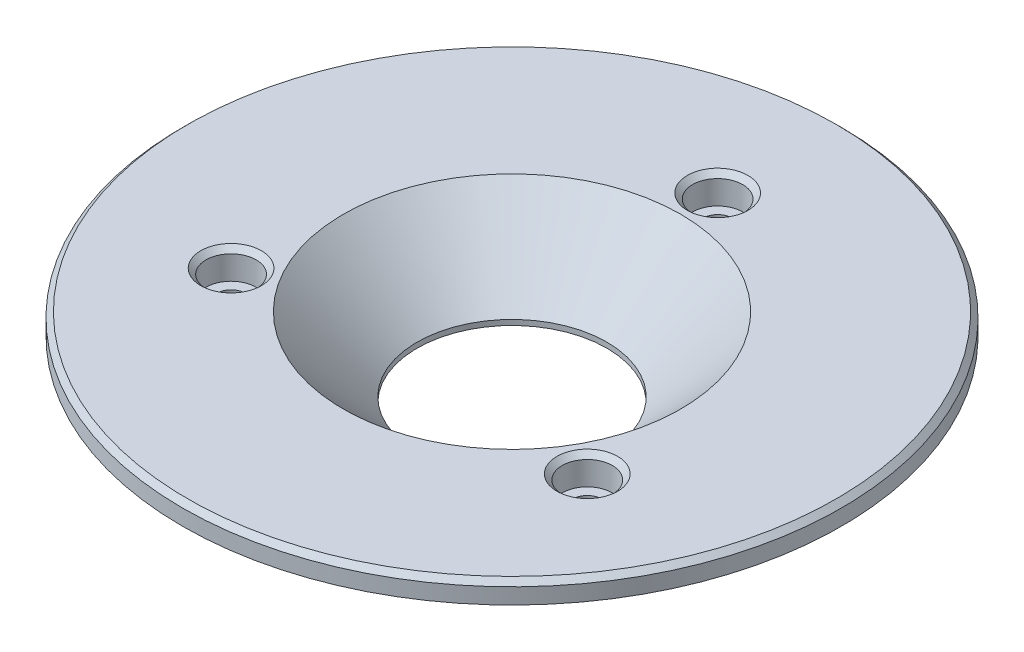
ISO-10303-21;
HEADER;
FILE_DESCRIPTION(('STEP AP214'),'2;1');
FILE_NAME('part.step','',(''),(''),'','','');
FILE_SCHEMA(('AUTOMOTIVE_DESIGN { 1 0 10303 214 1 1 1 1 }'));
ENDSEC;
DATA;
#1=APPLICATION_CONTEXT('core data for automotive mechanical design processes');
#2=APPLICATION_PROTOCOL_DEFINITION('international standard','automotive_design',2000,#1);
#3=PRODUCT_CONTEXT('',#1,'mechanical');
#4=PRODUCT('Part','Part','',(#3));
#5=PRODUCT_RELATED_PRODUCT_CATEGORY('part','',(#4));
#6=PRODUCT_DEFINITION_FORMATION('','',#4);
#7=PRODUCT_DEFINITION_CONTEXT('part definition',#1,'design');
#8=PRODUCT_DEFINITION('design','',#6,#7);
#9=PRODUCT_DEFINITION_SHAPE('','',#8);
#10=(LENGTH_UNIT() NAMED_UNIT(*) SI_UNIT(.MILLI.,.METRE.));
#11=(NAMED_UNIT(*) PLANE_ANGLE_UNIT() SI_UNIT($,.RADIAN.));
#12=(NAMED_UNIT(*) SI_UNIT($,.STERADIAN.) SOLID_ANGLE_UNIT());
#13=UNCERTAINTY_MEASURE_WITH_UNIT(LENGTH_MEASURE(1.E-05),#10,'distance_accuracy_value','');
#14=(GEOMETRIC_REPRESENTATION_CONTEXT(3) GLOBAL_UNCERTAINTY_ASSIGNED_CONTEXT((#13)) GLOBAL_UNIT_ASSIGNED_CONTEXT((#10,
#11,#12)) REPRESENTATION_CONTEXT('',''));
#15=CARTESIAN_POINT('',(0.,0.,0.));
#16=DIRECTION('',(0.,0.,1.));
#17=DIRECTION('',(1.,0.,0.));
#18=AXIS2_PLACEMENT_3D('',#15,#16,#17);
#19=CARTESIAN_POINT('',(-32.,15.,0.));
#20=DIRECTION('',(0.,-1.,0.));
#21=DIRECTION('',(0.,0.,-1.));
#22=AXIS2_PLACEMENT_3D('',#19,#20,#21);
#23=PLANE('',#22);
#24=CARTESIAN_POINT('',(33.7749907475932,15.,19.5));
#25=DIRECTION('',(0.,-1.,0.));
#26=DIRECTION('',(0.,0.,-1.));
#27=AXIS2_PLACEMENT_3D('',#24,#25,#26);
#28=CIRCLE('',#27,5.75);
#29=CARTESIAN_POINT('',(33.7749907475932,15.,13.75));
#30=VERTEX_POINT('',#29);
#31=EDGE_CURVE('E25',#30,#30,#28,.T.);
#32=ORIENTED_EDGE('',*,*,#31,.T.);
#33=EDGE_LOOP('',(#32));
#34=FACE_BOUND('',#33,.T.);
#35=CARTESIAN_POINT('',(0.,15.,-39.));
#36=DIRECTION('',(0.,-1.,0.));
#37=DIRECTION('',(0.,0.,-1.));
#38=AXIS2_PLACEMENT_3D('',#35,#36,#37);
#39=CIRCLE('',#38,5.75);
#40=CARTESIAN_POINT('',(0.,15.,-44.75));
#41=VERTEX_POINT('',#40);
#42=EDGE_CURVE('E29',#41,#41,#39,.T.);
#43=ORIENTED_EDGE('',*,*,#42,.T.);
#44=EDGE_LOOP('',(#43));
#45=FACE_BOUND('',#44,.T.);
#46=CARTESIAN_POINT('',(-33.7749907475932,15.,19.5));
#47=DIRECTION('',(0.,-1.,0.));
#48=DIRECTION('',(0.,0.,-1.));
#49=AXIS2_PLACEMENT_3D('',#46,#47,#48);
#50=CIRCLE('',#49,5.75);
#51=CARTESIAN_POINT('',(-33.7749907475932,15.,13.75));
#52=VERTEX_POINT('',#51);
#53=EDGE_CURVE('E34',#52,#52,#50,.T.);
#54=ORIENTED_EDGE('',*,*,#53,.T.);
#55=EDGE_LOOP('',(#54));
#56=FACE_BOUND('',#55,.T.);
#57=CARTESIAN_POINT('',(0.,15.,0.));
#58=DIRECTION('',(0.,-1.,0.));
#59=DIRECTION('',(0.,0.,-1.));
#60=AXIS2_PLACEMENT_3D('',#57,#58,#59);
#61=CIRCLE('',#60,61.5);
#62=CARTESIAN_POINT('',(0.,15.,-61.5));
#63=VERTEX_POINT('',#62);
#64=EDGE_CURVE('E58',#63,#63,#61,.F.);
#65=ORIENTED_EDGE('',*,*,#64,.T.);
#66=EDGE_LOOP('',(#65));
#67=FACE_BOUND('',#66,.T.);
#68=CARTESIAN_POINT('',(0.,15.,0.));
#69=DIRECTION('',(0.,-1.,0.));
#70=DIRECTION('',(0.,0.,-1.));
#71=AXIS2_PLACEMENT_3D('',#68,#69,#70);
#72=CIRCLE('',#71,32.);
#73=CARTESIAN_POINT('',(0.,15.,-32.));
#74=VERTEX_POINT('',#73);
#75=EDGE_CURVE('E70',#74,#74,#72,.T.);
#76=ORIENTED_EDGE('',*,*,#75,.T.);
#77=EDGE_LOOP('',(#76));
#78=FACE_BOUND('',#77,.T.);
#79=ADVANCED_FACE('F14',(#34,#45,#56,#67,#78),#23,.F.);
#80=CARTESIAN_POINT('',(0.,1.,0.));
#81=DIRECTION('',(0.,1.,0.));
#82=DIRECTION('',(0.,0.,1.));
#83=AXIS2_PLACEMENT_3D('',#80,#81,#82);
#84=CONICAL_SURFACE('',#83,18.,0.78539816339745);
#85=ORIENTED_EDGE('',*,*,#75,.F.);
#86=EDGE_LOOP('',(#85));
#87=FACE_BOUND('',#86,.T.);
#88=CARTESIAN_POINT('',(0.,1.,0.));
#89=DIRECTION('',(0.,-1.,0.));
#90=DIRECTION('',(0.,0.,-1.));
#91=AXIS2_PLACEMENT_3D('',#88,#89,#90);
#92=CIRCLE('',#91,18.);
#93=CARTESIAN_POINT('',(0.,1.,-18.));
#94=VERTEX_POINT('',#93);
#95=EDGE_CURVE('E83',#94,#94,#92,.T.);
#96=ORIENTED_EDGE('',*,*,#95,.T.);
#97=EDGE_LOOP('',(#96));
#98=FACE_BOUND('',#97,.T.);
#99=ADVANCED_FACE('F123',(#87,#98),#84,.F.);
#100=CARTESIAN_POINT('',(0.,0.,0.));
#101=DIRECTION('',(0.,-1.,0.));
#102=DIRECTION('',(0.,0.,-1.));
#103=AXIS2_PLACEMENT_3D('',#100,#101,#102);
#104=CYLINDRICAL_SURFACE('',#103,18.);
#105=ORIENTED_EDGE('',*,*,#95,.F.);
#106=EDGE_LOOP('',(#105));
#107=FACE_BOUND('',#106,.T.);
#108=CARTESIAN_POINT('',(0.,0.,0.));
#109=DIRECTION('',(0.,-1.,0.));
#110=DIRECTION('',(0.,0.,-1.));
#111=AXIS2_PLACEMENT_3D('',#108,#109,#110);
#112=CIRCLE('',#111,18.);
#113=CARTESIAN_POINT('',(0.,0.,-18.));
#114=VERTEX_POINT('',#113);
#115=EDGE_CURVE('E86',#114,#114,#112,.T.);
#116=ORIENTED_EDGE('',*,*,#115,.T.);
#117=EDGE_LOOP('',(#116));
#118=FACE_BOUND('',#117,.T.);
#119=ADVANCED_FACE('F130',(#107,#118),#104,.F.);
#120=CARTESIAN_POINT('',(-18.,0.,0.));
#121=DIRECTION('',(0.,1.,0.));
#122=DIRECTION('',(0.,0.,1.));
#123=AXIS2_PLACEMENT_3D('',#120,#121,#122);
#124=PLANE('',#123);
#125=CARTESIAN_POINT('',(-33.7749907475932,0.,19.5));
#126=DIRECTION('',(0.,1.,0.));
#127=DIRECTION('',(0.,0.,1.));
#128=AXIS2_PLACEMENT_3D('',#125,#126,#127);
#129=CIRCLE('',#128,3.74999999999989);
#130=CARTESIAN_POINT('',(-33.7749907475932,0.,23.2499999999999));
#131=VERTEX_POINT('',#130);
#132=EDGE_CURVE('E49',#131,#131,#129,.T.);
#133=ORIENTED_EDGE('',*,*,#132,.T.);
#134=EDGE_LOOP('',(#133));
#135=FACE_BOUND('',#134,.T.);
#136=CARTESIAN_POINT('',(33.7749907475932,0.,19.5));
#137=DIRECTION('',(0.,1.,0.));
#138=DIRECTION('',(0.,0.,1.));
#139=AXIS2_PLACEMENT_3D('',#136,#137,#138);
#140=CIRCLE('',#139,3.74999999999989);
#141=CARTESIAN_POINT('',(33.7749907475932,0.,23.2499999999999));
#142=VERTEX_POINT('',#141);
#143=EDGE_CURVE('E52',#142,#142,#140,.T.);
#144=ORIENTED_EDGE('',*,*,#143,.T.);
#145=EDGE_LOOP('',(#144));
#146=FACE_BOUND('',#145,.T.);
#147=CARTESIAN_POINT('',(0.,0.,-39.));
#148=DIRECTION('',(0.,1.,0.));
#149=DIRECTION('',(0.,0.,1.));
#150=AXIS2_PLACEMENT_3D('',#147,#148,#149);
#151=CIRCLE('',#150,3.74999999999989);
#152=CARTESIAN_POINT('',(0.,0.,-35.2500000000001));
#153=VERTEX_POINT('',#152);
#154=EDGE_CURVE('E55',#153,#153,#151,.T.);
#155=ORIENTED_EDGE('',*,*,#154,.T.);
#156=EDGE_LOOP('',(#155));
#157=FACE_BOUND('',#156,.T.);
#158=CARTESIAN_POINT('',(0.,0.,0.));
#159=DIRECTION('',(0.,1.,0.));
#160=DIRECTION('',(0.,0.,1.));
#161=AXIS2_PLACEMENT_3D('',#158,#159,#160);
#162=CIRCLE('',#161,44.);
#163=CARTESIAN_POINT('',(0.,0.,44.));
#164=VERTEX_POINT('',#163);
#165=EDGE_CURVE('E67',#164,#164,#162,.F.);
#166=ORIENTED_EDGE('',*,*,#165,.T.);
#167=EDGE_LOOP('',(#166));
#168=FACE_BOUND('',#167,.T.);
#169=ORIENTED_EDGE('',*,*,#115,.F.);
#170=EDGE_LOOP('',(#169));
#171=FACE_BOUND('',#170,.T.);
#172=ADVANCED_FACE('F181',(#135,#146,#157,#168,#171),#124,.F.);
#173=CARTESIAN_POINT('',(0.,0.,0.));
#174=DIRECTION('',(0.,-1.,0.));
#175=DIRECTION('',(0.,0.,-1.));
#176=AXIS2_PLACEMENT_3D('',#173,#174,#175);
#177=CYLINDRICAL_SURFACE('',#176,45.);
#178=CARTESIAN_POINT('',(0.,1.00000000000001,0.));
#179=DIRECTION('',(0.,1.,0.));
#180=DIRECTION('',(0.,0.,1.));
#181=AXIS2_PLACEMENT_3D('',#178,#179,#180);
#182=CIRCLE('',#181,45.);
#183=CARTESIAN_POINT('',(0.,1.00000000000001,45.));
#184=VERTEX_POINT('',#183);
#185=EDGE_CURVE('E64',#184,#184,#182,.T.);
#186=ORIENTED_EDGE('',*,*,#185,.T.);
#187=EDGE_LOOP('',(#186));
#188=FACE_BOUND('',#187,.T.);
#189=CARTESIAN_POINT('',(0.,11.,0.));
#190=DIRECTION('',(0.,-1.,0.));
#191=DIRECTION('',(0.,0.,-1.));
#192=AXIS2_PLACEMENT_3D('',#189,#190,#191);
#193=CIRCLE('',#192,45.);
#194=CARTESIAN_POINT('',(0.,11.,-45.));
#195=VERTEX_POINT('',#194);
#196=EDGE_CURVE('E89',#195,#195,#193,.T.);
#197=ORIENTED_EDGE('',*,*,#196,.T.);
#198=EDGE_LOOP('',(#197));
#199=FACE_BOUND('',#198,.T.);
#200=ADVANCED_FACE('F185',(#188,#199),#177,.T.);
#201=CARTESIAN_POINT('',(-45.,11.,0.));
#202=DIRECTION('',(0.,1.,0.));
#203=DIRECTION('',(0.,0.,1.));
#204=AXIS2_PLACEMENT_3D('',#201,#202,#203);
#205=PLANE('',#204);
#206=ORIENTED_EDGE('',*,*,#196,.F.);
#207=EDGE_LOOP('',(#206));
#208=FACE_BOUND('',#207,.T.);
#209=CARTESIAN_POINT('',(0.,11.,0.));
#210=DIRECTION('',(0.,-1.,0.));
#211=DIRECTION('',(0.,0.,-1.));
#212=AXIS2_PLACEMENT_3D('',#209,#210,#211);
#213=CIRCLE('',#212,62.5);
#214=CARTESIAN_POINT('',(0.,11.,-62.5));
#215=VERTEX_POINT('',#214);
#216=EDGE_CURVE('E92',#215,#215,#213,.T.);
#217=ORIENTED_EDGE('',*,*,#216,.T.);
#218=EDGE_LOOP('',(#217));
#219=FACE_BOUND('',#218,.T.);
#220=ADVANCED_FACE('F192',(#208,#219),#205,.F.);
#221=CARTESIAN_POINT('',(0.,0.,0.));
#222=DIRECTION('',(0.,-1.,0.));
#223=DIRECTION('',(0.,0.,-1.));
#224=AXIS2_PLACEMENT_3D('',#221,#222,#223);
#225=CYLINDRICAL_SURFACE('',#224,62.5);
#226=CARTESIAN_POINT('',(0.,14.,0.));
#227=DIRECTION('',(0.,-1.,0.));
#228=DIRECTION('',(0.,0.,-1.));
#229=AXIS2_PLACEMENT_3D('',#226,#227,#228);
#230=CIRCLE('',#229,62.5);
#231=CARTESIAN_POINT('',(0.,14.,-62.5));
#232=VERTEX_POINT('',#231);
#233=EDGE_CURVE('E61',#232,#232,#230,.T.);
#234=ORIENTED_EDGE('',*,*,#233,.T.);
#235=EDGE_LOOP('',(#234));
#236=FACE_BOUND('',#235,.T.);
#237=ORIENTED_EDGE('',*,*,#216,.F.);
#238=EDGE_LOOP('',(#237));
#239=FACE_BOUND('',#238,.T.);
#240=ADVANCED_FACE('F199',(#236,#239),#225,.T.);
#241=CARTESIAN_POINT('',(33.7749907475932,9.5,19.5));
#242=DIRECTION('',(0.,1.,0.));
#243=DIRECTION('',(0.,0.,1.));
#244=AXIS2_PLACEMENT_3D('',#241,#242,#243);
#245=CYLINDRICAL_SURFACE('',#244,4.75);
#246=CARTESIAN_POINT('',(33.7749907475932,14.,19.5));
#247=DIRECTION('',(0.,-1.,0.));
#248=DIRECTION('',(0.,0.,-1.));
#249=AXIS2_PLACEMENT_3D('',#246,#247,#248);
#250=CIRCLE('',#249,4.75);
#251=CARTESIAN_POINT('',(33.7749907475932,14.,14.75));
#252=VERTEX_POINT('',#251);
#253=EDGE_CURVE('E37',#252,#252,#250,.F.);
#254=ORIENTED_EDGE('',*,*,#253,.T.);
#255=EDGE_LOOP('',(#254));
#256=FACE_BOUND('',#255,.T.);
#257=CARTESIAN_POINT('',(33.7749907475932,9.5,19.5));
#258=DIRECTION('',(0.,1.,0.));
#259=DIRECTION('',(0.,0.,-1.));
#260=AXIS2_PLACEMENT_3D('',#257,#258,#259);
#261=CIRCLE('',#260,4.75);
#262=CARTESIAN_POINT('',(33.7749907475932,9.5,14.75));
#263=VERTEX_POINT('',#262);
#264=EDGE_CURVE('E74',#263,#263,#261,.T.);
#265=ORIENTED_EDGE('',*,*,#264,.F.);
#266=EDGE_LOOP('',(#265));
#267=FACE_BOUND('',#266,.T.);
#268=ADVANCED_FACE('F203',(#256,#267),#245,.F.);
#269=CARTESIAN_POINT('',(33.7749907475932,9.5,19.5));
#270=DIRECTION('',(0.,-1.,0.));
#271=DIRECTION('',(0.,0.,-1.));
#272=AXIS2_PLACEMENT_3D('',#269,#270,#271);
#273=PLANE('',#272);
#274=CARTESIAN_POINT('',(33.7749907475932,9.5,19.5));
#275=DIRECTION('',(0.,-1.,0.));
#276=DIRECTION('',(0.,0.,-1.));
#277=AXIS2_PLACEMENT_3D('',#274,#275,#276);
#278=CIRCLE('',#277,2.75);
#279=CARTESIAN_POINT('',(33.7749907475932,9.5,16.75));
#280=VERTEX_POINT('',#279);
#281=EDGE_CURVE('E71',#280,#280,#278,.T.);
#282=ORIENTED_EDGE('',*,*,#281,.T.);
#283=EDGE_LOOP('',(#282));
#284=FACE_BOUND('',#283,.T.);
#285=ORIENTED_EDGE('',*,*,#264,.T.);
#286=EDGE_LOOP('',(#285));
#287=FACE_BOUND('',#286,.T.);
#288=ADVANCED_FACE('F207',(#284,#287),#273,.F.);
#289=CARTESIAN_POINT('',(-33.7749907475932,9.5,19.5));
#290=DIRECTION('',(0.,1.,0.));
#291=DIRECTION('',(0.,0.,1.));
#292=AXIS2_PLACEMENT_3D('',#289,#290,#291);
#293=CYLINDRICAL_SURFACE('',#292,4.75);
#294=CARTESIAN_POINT('',(-33.7749907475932,14.,19.5));
#295=DIRECTION('',(0.,-1.,0.));
#296=DIRECTION('',(0.,0.,-1.));
#297=AXIS2_PLACEMENT_3D('',#294,#295,#296);
#298=CIRCLE('',#297,4.75);
#299=CARTESIAN_POINT('',(-33.7749907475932,14.,14.75));
#300=VERTEX_POINT('',#299);
#301=EDGE_CURVE('E9',#300,#300,#298,.F.);
#302=ORIENTED_EDGE('',*,*,#301,.T.);
#303=EDGE_LOOP('',(#302));
#304=FACE_BOUND('',#303,.T.);
#305=CARTESIAN_POINT('',(-33.7749907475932,9.5,19.5));
#306=DIRECTION('',(0.,1.,0.));
#307=DIRECTION('',(0.,0.,1.));
#308=AXIS2_PLACEMENT_3D('',#305,#306,#307);
#309=CIRCLE('',#308,4.75);
#310=CARTESIAN_POINT('',(-33.7749907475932,9.5,24.25));
#311=VERTEX_POINT('',#310);
#312=EDGE_CURVE('E98',#311,#311,#309,.T.);
#313=ORIENTED_EDGE('',*,*,#312,.F.);
#314=EDGE_LOOP('',(#313));
#315=FACE_BOUND('',#314,.T.);
#316=ADVANCED_FACE('F119',(#304,#315),#293,.F.);
#317=CARTESIAN_POINT('',(-33.7749907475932,9.5,19.5));
#318=DIRECTION('',(0.,1.,0.));
#319=DIRECTION('',(0.,0.,1.));
#320=AXIS2_PLACEMENT_3D('',#317,#318,#319);
#321=PLANE('',#320);
#322=CARTESIAN_POINT('',(-33.7749907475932,9.5,19.5));
#323=DIRECTION('',(0.,1.,0.));
#324=DIRECTION('',(0.,0.,1.));
#325=AXIS2_PLACEMENT_3D('',#322,#323,#324);
#326=CIRCLE('',#325,2.75);
#327=CARTESIAN_POINT('',(-33.7749907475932,9.5,22.25));
#328=VERTEX_POINT('',#327);
#329=EDGE_CURVE('E75',#328,#328,#326,.T.);
#330=ORIENTED_EDGE('',*,*,#329,.F.);
#331=EDGE_LOOP('',(#330));
#332=FACE_BOUND('',#331,.T.);
#333=ORIENTED_EDGE('',*,*,#312,.T.);
#334=EDGE_LOOP('',(#333));
#335=FACE_BOUND('',#334,.T.);
#336=ADVANCED_FACE('F108',(#332,#335),#321,.T.);
#337=CARTESIAN_POINT('',(0.,9.5,-39.));
#338=DIRECTION('',(0.,1.,0.));
#339=DIRECTION('',(0.,0.,1.));
#340=AXIS2_PLACEMENT_3D('',#337,#338,#339);
#341=CYLINDRICAL_SURFACE('',#340,4.75);
#342=CARTESIAN_POINT('',(0.,14.,-39.));
#343=DIRECTION('',(0.,-1.,0.));
#344=DIRECTION('',(0.,0.,-1.));
#345=AXIS2_PLACEMENT_3D('',#342,#343,#344);
#346=CIRCLE('',#345,4.75);
#347=CARTESIAN_POINT('',(0.,14.,-43.75));
#348=VERTEX_POINT('',#347);
#349=EDGE_CURVE('E21',#348,#348,#346,.F.);
#350=ORIENTED_EDGE('',*,*,#349,.T.);
#351=EDGE_LOOP('',(#350));
#352=FACE_BOUND('',#351,.T.);
#353=CARTESIAN_POINT('',(0.,9.5,-39.));
#354=DIRECTION('',(0.,1.,0.));
#355=DIRECTION('',(0.,0.,1.));
#356=AXIS2_PLACEMENT_3D('',#353,#354,#355);
#357=CIRCLE('',#356,4.75);
#358=CARTESIAN_POINT('',(0.,9.5,-34.25));
#359=VERTEX_POINT('',#358);
#360=EDGE_CURVE('E95',#359,#359,#357,.T.);
#361=ORIENTED_EDGE('',*,*,#360,.F.);
#362=EDGE_LOOP('',(#361));
#363=FACE_BOUND('',#362,.T.);
#364=ADVANCED_FACE('F106',(#352,#363),#341,.F.);
#365=CARTESIAN_POINT('',(0.,9.5,-39.));
#366=DIRECTION('',(0.,1.,0.));
#367=DIRECTION('',(0.,0.,1.));
#368=AXIS2_PLACEMENT_3D('',#365,#366,#367);
#369=PLANE('',#368);
#370=CARTESIAN_POINT('',(0.,9.5,-39.));
#371=DIRECTION('',(0.,1.,0.));
#372=DIRECTION('',(0.,0.,1.));
#373=AXIS2_PLACEMENT_3D('',#370,#371,#372);
#374=CIRCLE('',#373,2.75);
#375=CARTESIAN_POINT('',(0.,9.5,-36.25));
#376=VERTEX_POINT('',#375);
#377=EDGE_CURVE('E78',#376,#376,#374,.T.);
#378=ORIENTED_EDGE('',*,*,#377,.F.);
#379=EDGE_LOOP('',(#378));
#380=FACE_BOUND('',#379,.T.);
#381=ORIENTED_EDGE('',*,*,#360,.T.);
#382=EDGE_LOOP('',(#381));
#383=FACE_BOUND('',#382,.T.);
#384=ADVANCED_FACE('F104',(#380,#383),#369,.T.);
#385=CARTESIAN_POINT('',(0.,0.,-39.));
#386=DIRECTION('',(0.,1.,0.));
#387=DIRECTION('',(0.,0.,1.));
#388=AXIS2_PLACEMENT_3D('',#385,#386,#387);
#389=CYLINDRICAL_SURFACE('',#388,2.75);
#390=CARTESIAN_POINT('',(0.,0.999999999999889,-39.));
#391=DIRECTION('',(0.,1.,0.));
#392=DIRECTION('',(0.,0.,1.));
#393=AXIS2_PLACEMENT_3D('',#390,#391,#392);
#394=CIRCLE('',#393,2.75);
#395=CARTESIAN_POINT('',(0.,0.999999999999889,-36.25));
#396=VERTEX_POINT('',#395);
#397=EDGE_CURVE('E40',#396,#396,#394,.F.);
#398=ORIENTED_EDGE('',*,*,#397,.T.);
#399=EDGE_LOOP('',(#398));
#400=FACE_BOUND('',#399,.T.);
#401=ORIENTED_EDGE('',*,*,#377,.T.);
#402=EDGE_LOOP('',(#401));
#403=FACE_BOUND('',#402,.T.);
#404=ADVANCED_FACE('F116',(#400,#403),#389,.F.);
#405=CARTESIAN_POINT('',(-33.7749907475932,0.,19.5));
#406=DIRECTION('',(0.,1.,0.));
#407=DIRECTION('',(0.,0.,1.));
#408=AXIS2_PLACEMENT_3D('',#405,#406,#407);
#409=CYLINDRICAL_SURFACE('',#408,2.75);
#410=CARTESIAN_POINT('',(-33.7749907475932,0.999999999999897,19.5));
#411=DIRECTION('',(0.,1.,0.));
#412=DIRECTION('',(0.,0.,1.));
#413=AXIS2_PLACEMENT_3D('',#410,#411,#412);
#414=CIRCLE('',#413,2.75);
#415=CARTESIAN_POINT('',(-33.7749907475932,0.999999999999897,22.25));
#416=VERTEX_POINT('',#415);
#417=EDGE_CURVE('E46',#416,#416,#414,.F.);
#418=ORIENTED_EDGE('',*,*,#417,.T.);
#419=EDGE_LOOP('',(#418));
#420=FACE_BOUND('',#419,.T.);
#421=ORIENTED_EDGE('',*,*,#329,.T.);
#422=EDGE_LOOP('',(#421));
#423=FACE_BOUND('',#422,.T.);
#424=ADVANCED_FACE('F338',(#420,#423),#409,.F.);
#425=CARTESIAN_POINT('',(33.7749907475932,0.,19.5));
#426=DIRECTION('',(0.,1.,0.));
#427=DIRECTION('',(0.,0.,1.));
#428=AXIS2_PLACEMENT_3D('',#425,#426,#427);
#429=CYLINDRICAL_SURFACE('',#428,2.75);
#430=CARTESIAN_POINT('',(33.7749907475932,0.999999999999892,19.5));
#431=DIRECTION('',(0.,1.,0.));
#432=DIRECTION('',(0.,0.,1.));
#433=AXIS2_PLACEMENT_3D('',#430,#431,#432);
#434=CIRCLE('',#433,2.75);
#435=CARTESIAN_POINT('',(33.7749907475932,0.999999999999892,22.25));
#436=VERTEX_POINT('',#435);
#437=EDGE_CURVE('E43',#436,#436,#434,.F.);
#438=ORIENTED_EDGE('',*,*,#437,.T.);
#439=EDGE_LOOP('',(#438));
#440=FACE_BOUND('',#439,.T.);
#441=ORIENTED_EDGE('',*,*,#281,.F.);
#442=EDGE_LOOP('',(#441));
#443=FACE_BOUND('',#442,.T.);
#444=ADVANCED_FACE('F140',(#440,#443),#429,.F.);
#445=CARTESIAN_POINT('',(0.,0.,0.));
#446=DIRECTION('',(0.,1.,0.));
#447=DIRECTION('',(0.,0.,1.));
#448=AXIS2_PLACEMENT_3D('',#445,#446,#447);
#449=CONICAL_SURFACE('',#448,44.,0.785398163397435);
#450=ORIENTED_EDGE('',*,*,#185,.F.);
#451=EDGE_LOOP('',(#450));
#452=FACE_BOUND('',#451,.T.);
#453=ORIENTED_EDGE('',*,*,#165,.F.);
#454=EDGE_LOOP('',(#453));
#455=FACE_BOUND('',#454,.T.);
#456=ADVANCED_FACE('F136',(#452,#455),#449,.T.);
#457=CARTESIAN_POINT('',(0.,14.,0.));
#458=DIRECTION('',(0.,-1.,0.));
#459=DIRECTION('',(0.,0.,-1.));
#460=AXIS2_PLACEMENT_3D('',#457,#458,#459);
#461=CONICAL_SURFACE('',#460,62.5,0.785398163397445);
#462=ORIENTED_EDGE('',*,*,#64,.F.);
#463=EDGE_LOOP('',(#462));
#464=FACE_BOUND('',#463,.T.);
#465=ORIENTED_EDGE('',*,*,#233,.F.);
#466=EDGE_LOOP('',(#465));
#467=FACE_BOUND('',#466,.T.);
#468=ADVANCED_FACE('F139',(#464,#467),#461,.T.);
#469=CARTESIAN_POINT('',(-33.7749907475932,0.,19.5));
#470=DIRECTION('',(0.,-1.,0.));
#471=DIRECTION('',(0.,0.,-1.));
#472=AXIS2_PLACEMENT_3D('',#469,#470,#471);
#473=CONICAL_SURFACE('',#472,3.74999999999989,0.785398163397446);
#474=ORIENTED_EDGE('',*,*,#417,.F.);
#475=EDGE_LOOP('',(#474));
#476=FACE_BOUND('',#475,.T.);
#477=ORIENTED_EDGE('',*,*,#132,.F.);
#478=EDGE_LOOP('',(#477));
#479=FACE_BOUND('',#478,.T.);
#480=ADVANCED_FACE('F144',(#476,#479),#473,.F.);
#481=CARTESIAN_POINT('',(33.7749907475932,0.,19.5));
#482=DIRECTION('',(0.,-1.,0.));
#483=DIRECTION('',(0.,0.,-1.));
#484=AXIS2_PLACEMENT_3D('',#481,#482,#483);
#485=CONICAL_SURFACE('',#484,3.74999999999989,0.785398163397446);
#486=ORIENTED_EDGE('',*,*,#437,.F.);
#487=EDGE_LOOP('',(#486));
#488=FACE_BOUND('',#487,.T.);
#489=ORIENTED_EDGE('',*,*,#143,.F.);
#490=EDGE_LOOP('',(#489));
#491=FACE_BOUND('',#490,.T.);
#492=ADVANCED_FACE('F148',(#488,#491),#485,.F.);
#493=CARTESIAN_POINT('',(0.,0.,-39.));
#494=DIRECTION('',(0.,-1.,0.));
#495=DIRECTION('',(0.,0.,-1.));
#496=AXIS2_PLACEMENT_3D('',#493,#494,#495);
#497=CONICAL_SURFACE('',#496,3.74999999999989,0.785398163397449);
#498=ORIENTED_EDGE('',*,*,#397,.F.);
#499=EDGE_LOOP('',(#498));
#500=FACE_BOUND('',#499,.T.);
#501=ORIENTED_EDGE('',*,*,#154,.F.);
#502=EDGE_LOOP('',(#501));
#503=FACE_BOUND('',#502,.T.);
#504=ADVANCED_FACE('F152',(#500,#503),#497,.F.);
#505=CARTESIAN_POINT('',(33.7749907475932,14.,19.5));
#506=DIRECTION('',(0.,1.,0.));
#507=DIRECTION('',(0.,0.,1.));
#508=AXIS2_PLACEMENT_3D('',#505,#506,#507);
#509=CONICAL_SURFACE('',#508,4.75,0.785398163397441);
#510=ORIENTED_EDGE('',*,*,#31,.F.);
#511=EDGE_LOOP('',(#510));
#512=FACE_BOUND('',#511,.T.);
#513=ORIENTED_EDGE('',*,*,#253,.F.);
#514=EDGE_LOOP('',(#513));
#515=FACE_BOUND('',#514,.T.);
#516=ADVANCED_FACE('F156',(#512,#515),#509,.F.);
#517=CARTESIAN_POINT('',(0.,14.,-39.));
#518=DIRECTION('',(0.,1.,0.));
#519=DIRECTION('',(0.,0.,1.));
#520=AXIS2_PLACEMENT_3D('',#517,#518,#519);
#521=CONICAL_SURFACE('',#520,4.75,0.785398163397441);
#522=ORIENTED_EDGE('',*,*,#42,.F.);
#523=EDGE_LOOP('',(#522));
#524=FACE_BOUND('',#523,.T.);
#525=ORIENTED_EDGE('',*,*,#349,.F.);
#526=EDGE_LOOP('',(#525));
#527=FACE_BOUND('',#526,.T.);
#528=ADVANCED_FACE('F159',(#524,#527),#521,.F.);
#529=CARTESIAN_POINT('',(-33.7749907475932,14.,19.5));
#530=DIRECTION('',(0.,1.,0.));
#531=DIRECTION('',(0.,0.,1.));
#532=AXIS2_PLACEMENT_3D('',#529,#530,#531);
#533=CONICAL_SURFACE('',#532,4.75,0.785398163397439);
#534=ORIENTED_EDGE('',*,*,#53,.F.);
#535=EDGE_LOOP('',(#534));
#536=FACE_BOUND('',#535,.T.);
#537=ORIENTED_EDGE('',*,*,#301,.F.);
#538=EDGE_LOOP('',(#537));
#539=FACE_BOUND('',#538,.T.);
#540=ADVANCED_FACE('F16',(#536,#539),#533,.F.);
#541=CLOSED_SHELL('',(#79,#99,#119,#172,#200,#220,#240,#268,#288,#316,#336,#364,#384,#404,#424,
#444,#456,#468,#480,#492,#504,#516,#528,#540));
#542=MANIFOLD_SOLID_BREP('B1',#541);
#543=ADVANCED_BREP_SHAPE_REPRESENTATION('',(#18,#542),#14);
#544=SHAPE_DEFINITION_REPRESENTATION(#9,#543);
ENDSEC;
END-ISO-10303-21;
